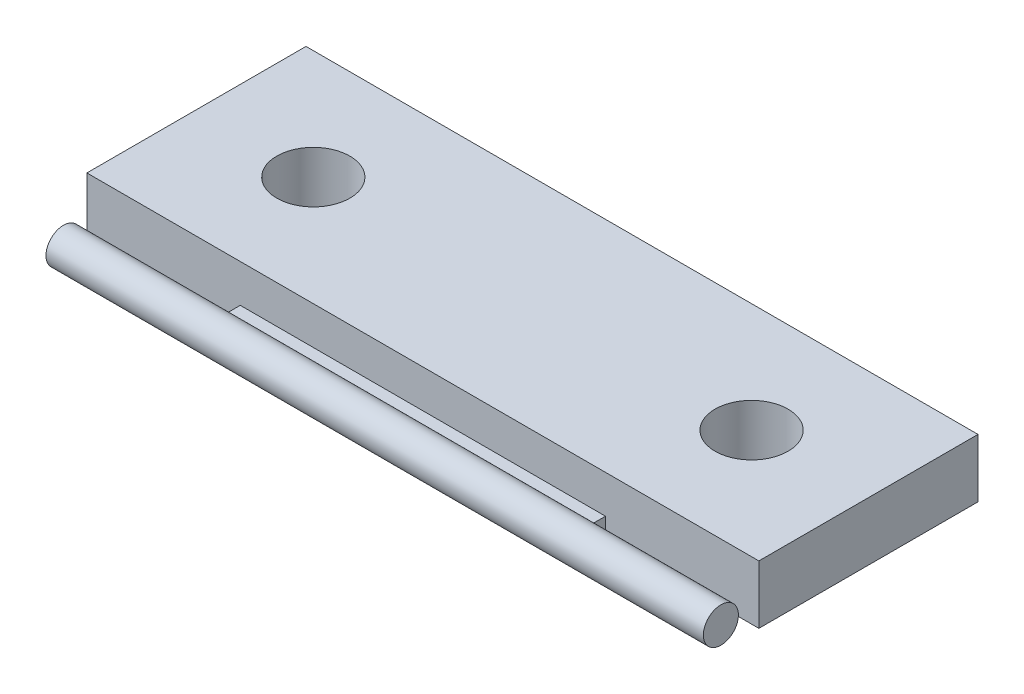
ISO-10303-21;
HEADER;
FILE_DESCRIPTION(('STEP AP214'),'2;1');
FILE_NAME('part.step','',(''),(''),'','','');
FILE_SCHEMA(('AUTOMOTIVE_DESIGN { 1 0 10303 214 1 1 1 1 }'));
ENDSEC;
DATA;
#1=APPLICATION_CONTEXT('core data for automotive mechanical design processes');
#2=APPLICATION_PROTOCOL_DEFINITION('international standard','automotive_design',2000,#1);
#3=PRODUCT_CONTEXT('',#1,'mechanical');
#4=PRODUCT('Part','Part','',(#3));
#5=PRODUCT_RELATED_PRODUCT_CATEGORY('part','',(#4));
#6=PRODUCT_DEFINITION_FORMATION('','',#4);
#7=PRODUCT_DEFINITION_CONTEXT('part definition',#1,'design');
#8=PRODUCT_DEFINITION('design','',#6,#7);
#9=PRODUCT_DEFINITION_SHAPE('','',#8);
#10=(LENGTH_UNIT() NAMED_UNIT(*) SI_UNIT(.MILLI.,.METRE.));
#11=(NAMED_UNIT(*) PLANE_ANGLE_UNIT() SI_UNIT($,.RADIAN.));
#12=(NAMED_UNIT(*) SI_UNIT($,.STERADIAN.) SOLID_ANGLE_UNIT());
#13=UNCERTAINTY_MEASURE_WITH_UNIT(LENGTH_MEASURE(1.E-05),#10,'distance_accuracy_value','');
#14=(GEOMETRIC_REPRESENTATION_CONTEXT(3) GLOBAL_UNCERTAINTY_ASSIGNED_CONTEXT((#13)) GLOBAL_UNIT_ASSIGNED_CONTEXT((#10,
#11,#12)) REPRESENTATION_CONTEXT('',''));
#15=CARTESIAN_POINT('',(0.,0.,0.));
#16=DIRECTION('',(0.,0.,1.));
#17=DIRECTION('',(1.,0.,0.));
#18=AXIS2_PLACEMENT_3D('',#15,#16,#17);
#19=CARTESIAN_POINT('',(-25.,2.,7.5));
#20=DIRECTION('',(0.,0.,-1.));
#21=DIRECTION('',(-1.,0.,0.));
#22=AXIS2_PLACEMENT_3D('',#19,#20,#21);
#23=PLANE('',#22);
#24=DIRECTION('',(1.,0.,0.));
#25=VECTOR('',#24,1.);
#26=CARTESIAN_POINT('',(-25.,4.,7.5));
#27=LINE('',#26,#25);
#28=CARTESIAN_POINT('',(-23.,4.,7.5));
#29=VERTEX_POINT('',#28);
#30=CARTESIAN_POINT('',(23.,4.,7.5));
#31=VERTEX_POINT('',#30);
#32=EDGE_CURVE('E116',#29,#31,#27,.T.);
#33=ORIENTED_EDGE('',*,*,#32,.F.);
#34=DIRECTION('',(0.,-1.,0.));
#35=VECTOR('',#34,1.);
#36=CARTESIAN_POINT('',(-23.,2.,7.5));
#37=LINE('',#36,#35);
#38=CARTESIAN_POINT('',(-23.,0.,7.5));
#39=VERTEX_POINT('',#38);
#40=EDGE_CURVE('E64',#29,#39,#37,.T.);
#41=ORIENTED_EDGE('',*,*,#40,.T.);
#42=DIRECTION('',(1.,0.,0.));
#43=VECTOR('',#42,1.);
#44=CARTESIAN_POINT('',(-25.,0.,7.5));
#45=LINE('',#44,#43);
#46=CARTESIAN_POINT('',(23.,0.,7.5));
#47=VERTEX_POINT('',#46);
#48=EDGE_CURVE('E118',#39,#47,#45,.T.);
#49=ORIENTED_EDGE('',*,*,#48,.T.);
#50=DIRECTION('',(0.,1.,0.));
#51=VECTOR('',#50,1.);
#52=CARTESIAN_POINT('',(23.,2.,7.5));
#53=LINE('',#52,#51);
#54=EDGE_CURVE('E105',#47,#31,#53,.T.);
#55=ORIENTED_EDGE('',*,*,#54,.T.);
#56=EDGE_LOOP('',(#33,#41,#49,#55));
#57=FACE_BOUND('',#56,.T.);
#58=DIRECTION('',(0.,1.,0.));
#59=VECTOR('',#58,1.);
#60=CARTESIAN_POINT('',(12.5,1.4,7.5));
#61=LINE('',#60,#59);
#62=CARTESIAN_POINT('',(12.5,0.6,7.5));
#63=VERTEX_POINT('',#62);
#64=CARTESIAN_POINT('',(12.5,1.4,7.5));
#65=VERTEX_POINT('',#64);
#66=EDGE_CURVE('E156',#63,#65,#61,.T.);
#67=ORIENTED_EDGE('',*,*,#66,.F.);
#68=DIRECTION('',(1.,0.,0.));
#69=VECTOR('',#68,1.);
#70=CARTESIAN_POINT('',(-12.5,0.6,7.50000000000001));
#71=LINE('',#70,#69);
#72=CARTESIAN_POINT('',(-12.5,0.6,7.50000000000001));
#73=VERTEX_POINT('',#72);
#74=EDGE_CURVE('E167',#73,#63,#71,.T.);
#75=ORIENTED_EDGE('',*,*,#74,.F.);
#76=DIRECTION('',(0.,1.,0.));
#77=VECTOR('',#76,1.);
#78=CARTESIAN_POINT('',(-12.5,1.4,7.50000000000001));
#79=LINE('',#78,#77);
#80=CARTESIAN_POINT('',(-12.5,1.4,7.50000000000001));
#81=VERTEX_POINT('',#80);
#82=EDGE_CURVE('E146',#73,#81,#79,.T.);
#83=ORIENTED_EDGE('',*,*,#82,.T.);
#84=DIRECTION('',(1.,0.,0.));
#85=VECTOR('',#84,1.);
#86=CARTESIAN_POINT('',(-12.5,1.4,7.50000000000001));
#87=LINE('',#86,#85);
#88=EDGE_CURVE('E164',#81,#65,#87,.T.);
#89=ORIENTED_EDGE('',*,*,#88,.T.);
#90=EDGE_LOOP('',(#67,#75,#83,#89));
#91=FACE_BOUND('',#90,.T.);
#92=ADVANCED_FACE('F42',(#57,#91),#23,.F.);
#93=CARTESIAN_POINT('',(-25.,2.,-7.5));
#94=DIRECTION('',(0.,0.,1.));
#95=DIRECTION('',(1.,0.,0.));
#96=AXIS2_PLACEMENT_3D('',#93,#94,#95);
#97=PLANE('',#96);
#98=DIRECTION('',(-1.,0.,0.));
#99=VECTOR('',#98,1.);
#100=CARTESIAN_POINT('',(-25.,0.,-7.5));
#101=LINE('',#100,#99);
#102=CARTESIAN_POINT('',(23.,0.,-7.5));
#103=VERTEX_POINT('',#102);
#104=CARTESIAN_POINT('',(-23.,0.,-7.5));
#105=VERTEX_POINT('',#104);
#106=EDGE_CURVE('E163',#103,#105,#101,.T.);
#107=ORIENTED_EDGE('',*,*,#106,.T.);
#108=DIRECTION('',(0.,1.,0.));
#109=VECTOR('',#108,1.);
#110=CARTESIAN_POINT('',(-23.,2.,-7.5));
#111=LINE('',#110,#109);
#112=CARTESIAN_POINT('',(-23.,4.,-7.5));
#113=VERTEX_POINT('',#112);
#114=EDGE_CURVE('E192',#105,#113,#111,.T.);
#115=ORIENTED_EDGE('',*,*,#114,.T.);
#116=DIRECTION('',(-1.,0.,0.));
#117=VECTOR('',#116,1.);
#118=CARTESIAN_POINT('',(25.,4.,-7.5));
#119=LINE('',#118,#117);
#120=CARTESIAN_POINT('',(23.,4.,-7.5));
#121=VERTEX_POINT('',#120);
#122=EDGE_CURVE('E123',#121,#113,#119,.T.);
#123=ORIENTED_EDGE('',*,*,#122,.F.);
#124=DIRECTION('',(0.,-1.,0.));
#125=VECTOR('',#124,1.);
#126=CARTESIAN_POINT('',(23.,2.,-7.5));
#127=LINE('',#126,#125);
#128=EDGE_CURVE('E57',#121,#103,#127,.T.);
#129=ORIENTED_EDGE('',*,*,#128,.T.);
#130=EDGE_LOOP('',(#107,#115,#123,#129));
#131=FACE_BOUND('',#130,.T.);
#132=ADVANCED_FACE('F44',(#131),#97,.F.);
#133=CARTESIAN_POINT('',(0.,0.,0.));
#134=DIRECTION('',(0.,1.,0.));
#135=DIRECTION('',(0.,0.,1.));
#136=AXIS2_PLACEMENT_3D('',#133,#134,#135);
#137=PLANE('',#136);
#138=CARTESIAN_POINT('',(-15.,0.,0.));
#139=DIRECTION('',(0.,1.,0.));
#140=DIRECTION('',(0.,0.,1.));
#141=AXIS2_PLACEMENT_3D('',#138,#139,#140);
#142=CIRCLE('',#141,2.5);
#143=CARTESIAN_POINT('',(-15.,0.,2.5));
#144=VERTEX_POINT('',#143);
#145=EDGE_CURVE('E137',#144,#144,#142,.T.);
#146=ORIENTED_EDGE('',*,*,#145,.T.);
#147=EDGE_LOOP('',(#146));
#148=FACE_BOUND('',#147,.T.);
#149=CARTESIAN_POINT('',(15.,0.,0.));
#150=DIRECTION('',(0.,1.,0.));
#151=DIRECTION('',(0.,0.,1.));
#152=AXIS2_PLACEMENT_3D('',#149,#150,#151);
#153=CIRCLE('',#152,2.5);
#154=CARTESIAN_POINT('',(15.,0.,2.5));
#155=VERTEX_POINT('',#154);
#156=EDGE_CURVE('E126',#155,#155,#153,.T.);
#157=ORIENTED_EDGE('',*,*,#156,.T.);
#158=EDGE_LOOP('',(#157));
#159=FACE_BOUND('',#158,.T.);
#160=ORIENTED_EDGE('',*,*,#48,.F.);
#161=DIRECTION('',(0.,0.,-1.));
#162=VECTOR('',#161,1.);
#163=CARTESIAN_POINT('',(-23.,0.,0.));
#164=LINE('',#163,#162);
#165=EDGE_CURVE('E119',#39,#105,#164,.T.);
#166=ORIENTED_EDGE('',*,*,#165,.T.);
#167=ORIENTED_EDGE('',*,*,#106,.F.);
#168=DIRECTION('',(0.,0.,1.));
#169=VECTOR('',#168,1.);
#170=CARTESIAN_POINT('',(23.,0.,0.));
#171=LINE('',#170,#169);
#172=EDGE_CURVE('E200',#103,#47,#171,.T.);
#173=ORIENTED_EDGE('',*,*,#172,.T.);
#174=EDGE_LOOP('',(#160,#166,#167,#173));
#175=FACE_BOUND('',#174,.T.);
#176=ADVANCED_FACE('F181',(#148,#159,#175),#137,.F.);
#177=CARTESIAN_POINT('',(-12.5,1.,9.60000000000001));
#178=DIRECTION('',(1.,0.,0.));
#179=DIRECTION('',(0.,0.,-1.));
#180=AXIS2_PLACEMENT_3D('',#177,#178,#179);
#181=CYLINDRICAL_SURFACE('',#180,1.2);
#182=DIRECTION('',(1.,0.,0.));
#183=VECTOR('',#182,1.);
#184=CARTESIAN_POINT('',(-12.5,0.6,8.46862915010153));
#185=LINE('',#184,#183);
#186=CARTESIAN_POINT('',(-12.5,0.6,8.46862915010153));
#187=VERTEX_POINT('',#186);
#188=CARTESIAN_POINT('',(12.5,0.6,8.46862915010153));
#189=VERTEX_POINT('',#188);
#190=EDGE_CURVE('E153',#187,#189,#185,.T.);
#191=ORIENTED_EDGE('',*,*,#190,.T.);
#192=CARTESIAN_POINT('',(12.5,1.,9.6));
#193=DIRECTION('',(1.,0.,0.));
#194=DIRECTION('',(0.,0.,-1.));
#195=AXIS2_PLACEMENT_3D('',#192,#193,#194);
#196=CIRCLE('',#195,1.2);
#197=CARTESIAN_POINT('',(12.5,1.4,8.46862915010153));
#198=VERTEX_POINT('',#197);
#199=EDGE_CURVE('E111',#189,#198,#196,.T.);
#200=ORIENTED_EDGE('',*,*,#199,.T.);
#201=DIRECTION('',(1.,0.,0.));
#202=VECTOR('',#201,1.);
#203=CARTESIAN_POINT('',(-12.5,1.4,8.46862915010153));
#204=LINE('',#203,#202);
#205=CARTESIAN_POINT('',(-12.5,1.4,8.46862915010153));
#206=VERTEX_POINT('',#205);
#207=EDGE_CURVE('E160',#206,#198,#204,.T.);
#208=ORIENTED_EDGE('',*,*,#207,.F.);
#209=CARTESIAN_POINT('',(-12.5,1.,9.60000000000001));
#210=DIRECTION('',(1.,0.,0.));
#211=DIRECTION('',(0.,0.,-1.));
#212=AXIS2_PLACEMENT_3D('',#209,#210,#211);
#213=CIRCLE('',#212,1.2);
#214=EDGE_CURVE('E140',#187,#206,#213,.T.);
#215=ORIENTED_EDGE('',*,*,#214,.F.);
#216=EDGE_LOOP('',(#191,#200,#208,#215));
#217=FACE_BOUND('',#216,.T.);
#218=CARTESIAN_POINT('',(22.5,1.,9.6));
#219=DIRECTION('',(1.,0.,0.));
#220=DIRECTION('',(0.,0.,-1.));
#221=AXIS2_PLACEMENT_3D('',#218,#219,#220);
#222=CIRCLE('',#221,1.2);
#223=CARTESIAN_POINT('',(22.5,1.,8.4));
#224=VERTEX_POINT('',#223);
#225=EDGE_CURVE('E133',#224,#224,#222,.T.);
#226=ORIENTED_EDGE('',*,*,#225,.F.);
#227=EDGE_LOOP('',(#226));
#228=FACE_BOUND('',#227,.T.);
#229=CARTESIAN_POINT('',(-22.5,1.,9.60000000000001));
#230=DIRECTION('',(1.,0.,0.));
#231=DIRECTION('',(0.,0.,-1.));
#232=AXIS2_PLACEMENT_3D('',#229,#230,#231);
#233=CIRCLE('',#232,1.2);
#234=CARTESIAN_POINT('',(-22.5,1.,8.40000000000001));
#235=VERTEX_POINT('',#234);
#236=EDGE_CURVE('E136',#235,#235,#233,.T.);
#237=ORIENTED_EDGE('',*,*,#236,.T.);
#238=EDGE_LOOP('',(#237));
#239=FACE_BOUND('',#238,.T.);
#240=ADVANCED_FACE('F218',(#217,#228,#239),#181,.T.);
#241=CARTESIAN_POINT('',(-12.5,1.4,8.46862915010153));
#242=DIRECTION('',(0.,1.,0.));
#243=DIRECTION('',(0.,0.,1.));
#244=AXIS2_PLACEMENT_3D('',#241,#242,#243);
#245=PLANE('',#244);
#246=DIRECTION('',(0.,0.,1.));
#247=VECTOR('',#246,1.);
#248=CARTESIAN_POINT('',(12.5,1.4,8.46862915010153));
#249=LINE('',#248,#247);
#250=EDGE_CURVE('E147',#65,#198,#249,.T.);
#251=ORIENTED_EDGE('',*,*,#250,.F.);
#252=ORIENTED_EDGE('',*,*,#88,.F.);
#253=DIRECTION('',(0.,0.,1.));
#254=VECTOR('',#253,1.);
#255=CARTESIAN_POINT('',(-12.5,1.4,8.46862915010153));
#256=LINE('',#255,#254);
#257=EDGE_CURVE('E150',#81,#206,#256,.T.);
#258=ORIENTED_EDGE('',*,*,#257,.T.);
#259=ORIENTED_EDGE('',*,*,#207,.T.);
#260=EDGE_LOOP('',(#251,#252,#258,#259));
#261=FACE_BOUND('',#260,.T.);
#262=ADVANCED_FACE('F221',(#261),#245,.T.);
#263=CARTESIAN_POINT('',(-12.5,0.6,8.46862915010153));
#264=DIRECTION('',(0.,-1.,0.));
#265=DIRECTION('',(0.,0.,-1.));
#266=AXIS2_PLACEMENT_3D('',#263,#264,#265);
#267=PLANE('',#266);
#268=DIRECTION('',(0.,0.,-1.));
#269=VECTOR('',#268,1.);
#270=CARTESIAN_POINT('',(12.5,0.6,8.46862915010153));
#271=LINE('',#270,#269);
#272=EDGE_CURVE('E142',#189,#63,#271,.T.);
#273=ORIENTED_EDGE('',*,*,#272,.F.);
#274=ORIENTED_EDGE('',*,*,#190,.F.);
#275=DIRECTION('',(0.,0.,-1.));
#276=VECTOR('',#275,1.);
#277=CARTESIAN_POINT('',(-12.5,0.6,8.46862915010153));
#278=LINE('',#277,#276);
#279=EDGE_CURVE('E143',#187,#73,#278,.T.);
#280=ORIENTED_EDGE('',*,*,#279,.T.);
#281=ORIENTED_EDGE('',*,*,#74,.T.);
#282=EDGE_LOOP('',(#273,#274,#280,#281));
#283=FACE_BOUND('',#282,.T.);
#284=ADVANCED_FACE('F223',(#283),#267,.T.);
#285=CARTESIAN_POINT('',(-12.5,1.,9.60000000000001));
#286=DIRECTION('',(1.,0.,0.));
#287=DIRECTION('',(0.,0.,-1.));
#288=AXIS2_PLACEMENT_3D('',#285,#286,#287);
#289=PLANE('',#288);
#290=ORIENTED_EDGE('',*,*,#279,.F.);
#291=ORIENTED_EDGE('',*,*,#214,.T.);
#292=ORIENTED_EDGE('',*,*,#257,.F.);
#293=ORIENTED_EDGE('',*,*,#82,.F.);
#294=EDGE_LOOP('',(#290,#291,#292,#293));
#295=FACE_BOUND('',#294,.T.);
#296=ADVANCED_FACE('F226',(#295),#289,.F.);
#297=CARTESIAN_POINT('',(12.5,1.,9.6));
#298=DIRECTION('',(1.,0.,0.));
#299=DIRECTION('',(0.,0.,-1.));
#300=AXIS2_PLACEMENT_3D('',#297,#298,#299);
#301=PLANE('',#300);
#302=ORIENTED_EDGE('',*,*,#199,.F.);
#303=ORIENTED_EDGE('',*,*,#272,.T.);
#304=ORIENTED_EDGE('',*,*,#66,.T.);
#305=ORIENTED_EDGE('',*,*,#250,.T.);
#306=EDGE_LOOP('',(#302,#303,#304,#305));
#307=FACE_BOUND('',#306,.T.);
#308=ADVANCED_FACE('F231',(#307),#301,.T.);
#309=CARTESIAN_POINT('',(22.5,1.,9.6));
#310=DIRECTION('',(1.,0.,0.));
#311=DIRECTION('',(0.,0.,-1.));
#312=AXIS2_PLACEMENT_3D('',#309,#310,#311);
#313=PLANE('',#312);
#314=ORIENTED_EDGE('',*,*,#225,.T.);
#315=EDGE_LOOP('',(#314));
#316=FACE_BOUND('',#315,.T.);
#317=ADVANCED_FACE('F234',(#316),#313,.T.);
#318=CARTESIAN_POINT('',(-22.5,1.,9.60000000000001));
#319=DIRECTION('',(1.,0.,0.));
#320=DIRECTION('',(0.,0.,-1.));
#321=AXIS2_PLACEMENT_3D('',#318,#319,#320);
#322=PLANE('',#321);
#323=ORIENTED_EDGE('',*,*,#236,.F.);
#324=EDGE_LOOP('',(#323));
#325=FACE_BOUND('',#324,.T.);
#326=ADVANCED_FACE('F239',(#325),#322,.F.);
#327=CARTESIAN_POINT('',(15.,-8.,0.));
#328=DIRECTION('',(0.,1.,0.));
#329=DIRECTION('',(0.,0.,1.));
#330=AXIS2_PLACEMENT_3D('',#327,#328,#329);
#331=CYLINDRICAL_SURFACE('',#330,2.5);
#332=ORIENTED_EDGE('',*,*,#156,.F.);
#333=EDGE_LOOP('',(#332));
#334=FACE_BOUND('',#333,.T.);
#335=CARTESIAN_POINT('',(15.,4.,0.));
#336=DIRECTION('',(0.,1.,0.));
#337=DIRECTION('',(0.,0.,1.));
#338=AXIS2_PLACEMENT_3D('',#335,#336,#337);
#339=CIRCLE('',#338,2.5);
#340=CARTESIAN_POINT('',(15.,4.,2.5));
#341=VERTEX_POINT('',#340);
#342=EDGE_CURVE('E124',#341,#341,#339,.T.);
#343=ORIENTED_EDGE('',*,*,#342,.T.);
#344=EDGE_LOOP('',(#343));
#345=FACE_BOUND('',#344,.T.);
#346=ADVANCED_FACE('F187',(#334,#345),#331,.F.);
#347=CARTESIAN_POINT('',(-15.,-8.,0.));
#348=DIRECTION('',(0.,1.,0.));
#349=DIRECTION('',(0.,0.,1.));
#350=AXIS2_PLACEMENT_3D('',#347,#348,#349);
#351=CYLINDRICAL_SURFACE('',#350,2.5);
#352=ORIENTED_EDGE('',*,*,#145,.F.);
#353=EDGE_LOOP('',(#352));
#354=FACE_BOUND('',#353,.T.);
#355=CARTESIAN_POINT('',(-15.,4.,0.));
#356=DIRECTION('',(0.,1.,0.));
#357=DIRECTION('',(0.,0.,1.));
#358=AXIS2_PLACEMENT_3D('',#355,#356,#357);
#359=CIRCLE('',#358,2.5);
#360=CARTESIAN_POINT('',(-15.,4.,2.5));
#361=VERTEX_POINT('',#360);
#362=EDGE_CURVE('E129',#361,#361,#359,.T.);
#363=ORIENTED_EDGE('',*,*,#362,.T.);
#364=EDGE_LOOP('',(#363));
#365=FACE_BOUND('',#364,.T.);
#366=ADVANCED_FACE('F184',(#354,#365),#351,.F.);
#367=CARTESIAN_POINT('',(0.,4.,0.));
#368=DIRECTION('',(0.,1.,0.));
#369=DIRECTION('',(0.,0.,1.));
#370=AXIS2_PLACEMENT_3D('',#367,#368,#369);
#371=PLANE('',#370);
#372=DIRECTION('',(0.,0.,-1.));
#373=VECTOR('',#372,1.);
#374=CARTESIAN_POINT('',(-23.,4.,0.));
#375=LINE('',#374,#373);
#376=EDGE_CURVE('E11',#29,#113,#375,.T.);
#377=ORIENTED_EDGE('',*,*,#376,.F.);
#378=ORIENTED_EDGE('',*,*,#32,.T.);
#379=DIRECTION('',(0.,0.,1.));
#380=VECTOR('',#379,1.);
#381=CARTESIAN_POINT('',(23.,4.,0.));
#382=LINE('',#381,#380);
#383=EDGE_CURVE('E50',#121,#31,#382,.T.);
#384=ORIENTED_EDGE('',*,*,#383,.F.);
#385=ORIENTED_EDGE('',*,*,#122,.T.);
#386=EDGE_LOOP('',(#377,#378,#384,#385));
#387=FACE_BOUND('',#386,.T.);
#388=ORIENTED_EDGE('',*,*,#342,.F.);
#389=EDGE_LOOP('',(#388));
#390=FACE_BOUND('',#389,.T.);
#391=ORIENTED_EDGE('',*,*,#362,.F.);
#392=EDGE_LOOP('',(#391));
#393=FACE_BOUND('',#392,.T.);
#394=ADVANCED_FACE('F121',(#387,#390,#393),#371,.T.);
#395=CARTESIAN_POINT('',(23.,-6.,-10.8150747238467));
#396=DIRECTION('',(-1.,0.,0.));
#397=DIRECTION('',(0.,0.,1.));
#398=AXIS2_PLACEMENT_3D('',#395,#396,#397);
#399=PLANE('',#398);
#400=ORIENTED_EDGE('',*,*,#172,.F.);
#401=ORIENTED_EDGE('',*,*,#128,.F.);
#402=ORIENTED_EDGE('',*,*,#383,.T.);
#403=ORIENTED_EDGE('',*,*,#54,.F.);
#404=EDGE_LOOP('',(#400,#401,#402,#403));
#405=FACE_BOUND('',#404,.T.);
#406=ADVANCED_FACE('F104',(#405),#399,.F.);
#407=CARTESIAN_POINT('',(-23.,-6.,-10.8150747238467));
#408=DIRECTION('',(1.,0.,0.));
#409=DIRECTION('',(0.,0.,-1.));
#410=AXIS2_PLACEMENT_3D('',#407,#408,#409);
#411=PLANE('',#410);
#412=ORIENTED_EDGE('',*,*,#376,.T.);
#413=ORIENTED_EDGE('',*,*,#114,.F.);
#414=ORIENTED_EDGE('',*,*,#165,.F.);
#415=ORIENTED_EDGE('',*,*,#40,.F.);
#416=EDGE_LOOP('',(#412,#413,#414,#415));
#417=FACE_BOUND('',#416,.T.);
#418=ADVANCED_FACE('F204',(#417),#411,.F.);
#419=CLOSED_SHELL('',(#92,#132,#176,#240,#262,#284,#296,#308,#317,#326,#346,#366,#394,#406,#418));
#420=MANIFOLD_SOLID_BREP('B2',#419);
#421=ADVANCED_BREP_SHAPE_REPRESENTATION('',(#18,#420),#14);
#422=SHAPE_DEFINITION_REPRESENTATION(#9,#421);
ENDSEC;
END-ISO-10303-21;
